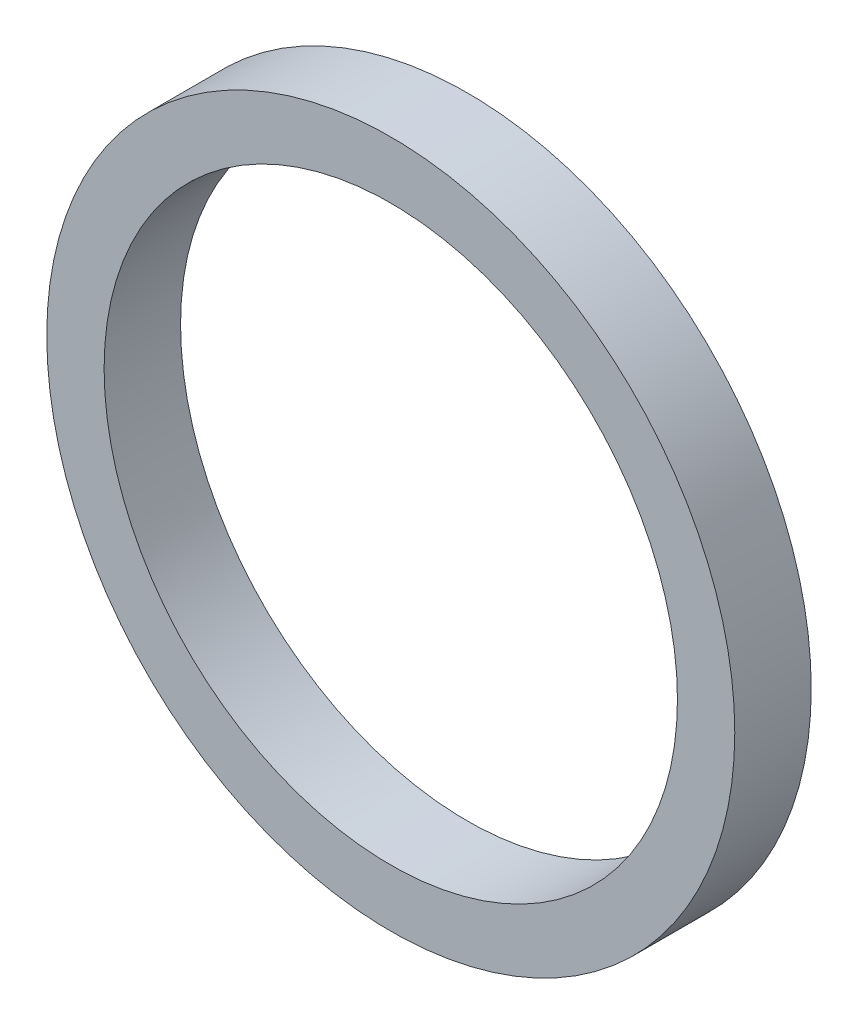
from build123d import *

# Parameters (mm, degrees)
SKETCH1_R          = 18
SKETCH1_R_2        = 15
BASE_EXTRUDE_DEPTH = 4


with BuildPart() as part:
    # Sketch1 → Base-Extrude (new body)
    with BuildSketch(Plane.XY):
        Circle(SKETCH1_R)
        Circle(SKETCH1_R_2, mode=Mode.SUBTRACT)
    extrude(amount=-BASE_EXTRUDE_DEPTH)


solid = part.part
